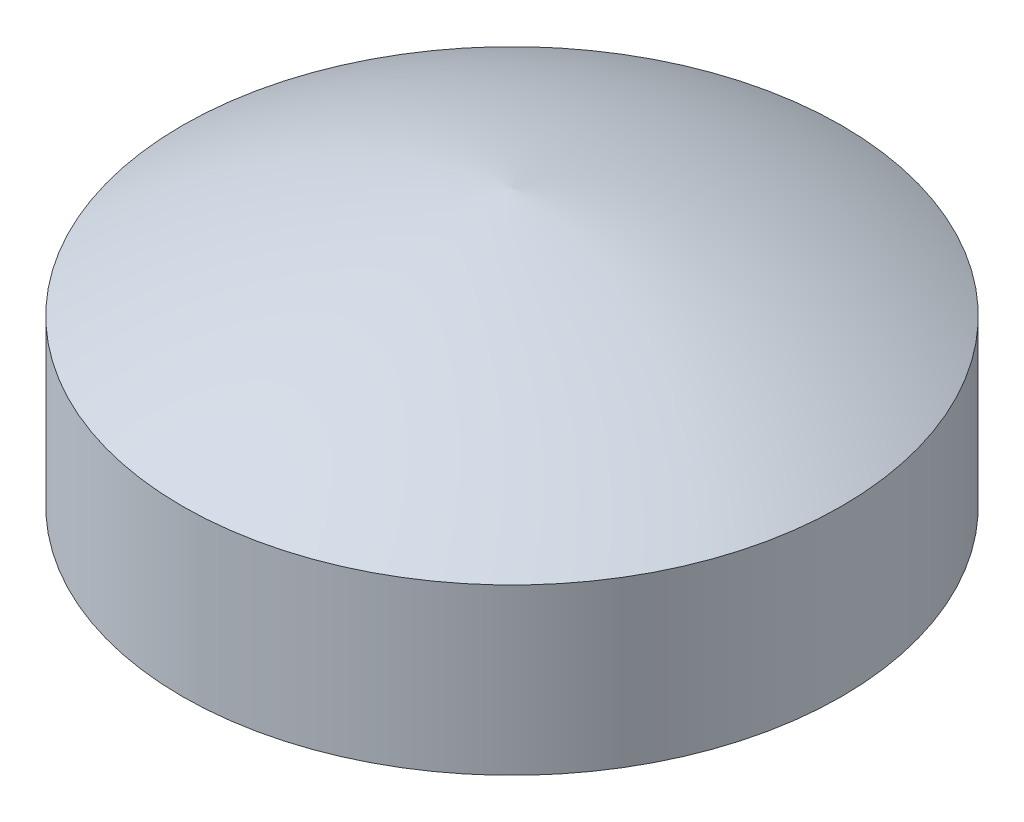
ISO-10303-21;
HEADER;
FILE_DESCRIPTION(('STEP AP214'),'2;1');
FILE_NAME('part.step','',(''),(''),'','','');
FILE_SCHEMA(('AUTOMOTIVE_DESIGN { 1 0 10303 214 1 1 1 1 }'));
ENDSEC;
DATA;
#1=APPLICATION_CONTEXT('core data for automotive mechanical design processes');
#2=APPLICATION_PROTOCOL_DEFINITION('international standard','automotive_design',2000,#1);
#3=PRODUCT_CONTEXT('',#1,'mechanical');
#4=PRODUCT('Part','Part','',(#3));
#5=PRODUCT_RELATED_PRODUCT_CATEGORY('part','',(#4));
#6=PRODUCT_DEFINITION_FORMATION('','',#4);
#7=PRODUCT_DEFINITION_CONTEXT('part definition',#1,'design');
#8=PRODUCT_DEFINITION('design','',#6,#7);
#9=PRODUCT_DEFINITION_SHAPE('','',#8);
#10=(LENGTH_UNIT() NAMED_UNIT(*) SI_UNIT(.MILLI.,.METRE.));
#11=(NAMED_UNIT(*) PLANE_ANGLE_UNIT() SI_UNIT($,.RADIAN.));
#12=(NAMED_UNIT(*) SI_UNIT($,.STERADIAN.) SOLID_ANGLE_UNIT());
#13=UNCERTAINTY_MEASURE_WITH_UNIT(LENGTH_MEASURE(1.E-05),#10,'distance_accuracy_value','');
#14=(GEOMETRIC_REPRESENTATION_CONTEXT(3) GLOBAL_UNCERTAINTY_ASSIGNED_CONTEXT((#13)) GLOBAL_UNIT_ASSIGNED_CONTEXT((#10,
#11,#12)) REPRESENTATION_CONTEXT('',''));
#15=CARTESIAN_POINT('',(0.,0.,0.));
#16=DIRECTION('',(0.,0.,1.));
#17=DIRECTION('',(1.,0.,0.));
#18=AXIS2_PLACEMENT_3D('',#15,#16,#17);
#19=CARTESIAN_POINT('',(0.,-5.17827346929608,0.892757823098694));
#20=DIRECTION('',(-1.,0.,0.));
#21=DIRECTION('',(0.,0.,-1.));
#22=AXIS2_PLACEMENT_3D('',#19,#20,#21);
#23=CIRCLE('',#22,7.73);
#24=TRIMMED_CURVE('',#23,(PARAMETER_VALUE(-1.45504541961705)),
(PARAMETER_VALUE(1.45504541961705)),.T.,.PARAMETER.);
#25=CARTESIAN_POINT('',(0.,-5.17827346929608,0.));
#26=DIRECTION('',(0.,-1.,0.));
#27=AXIS1_PLACEMENT('',#25,#26);
#28=SURFACE_OF_REVOLUTION('',#24,#27);
#29=CARTESIAN_POINT('',(0.,2.5,0.));
#30=VERTEX_POINT('',#29);
#31=VERTEX_LOOP('',#30);
#32=FACE_BOUND('',#31,.T.);
#33=CARTESIAN_POINT('',(0.,1.5,0.));
#34=DIRECTION('',(0.,-1.,0.));
#35=DIRECTION('',(0.,0.,-1.));
#36=AXIS2_PLACEMENT_3D('',#33,#34,#35);
#37=CIRCLE('',#36,3.);
#38=CARTESIAN_POINT('',(0.,1.5,-3.));
#39=VERTEX_POINT('',#38);
#40=EDGE_CURVE('E11',#39,#39,#37,.T.);
#41=ORIENTED_EDGE('',*,*,#40,.F.);
#42=EDGE_LOOP('',(#41));
#43=FACE_BOUND('',#42,.T.);
#44=ADVANCED_FACE('F35',(#32,#43),#28,.T.);
#45=CARTESIAN_POINT('',(0.,0.,0.));
#46=DIRECTION('',(0.,-1.,0.));
#47=DIRECTION('',(0.,0.,-1.));
#48=AXIS2_PLACEMENT_3D('',#45,#46,#47);
#49=CYLINDRICAL_SURFACE('',#48,3.);
#50=ORIENTED_EDGE('',*,*,#40,.T.);
#51=EDGE_LOOP('',(#50));
#52=FACE_BOUND('',#51,.T.);
#53=CARTESIAN_POINT('',(0.,0.,0.));
#54=DIRECTION('',(0.,-1.,0.));
#55=DIRECTION('',(0.,0.,-1.));
#56=AXIS2_PLACEMENT_3D('',#53,#54,#55);
#57=CIRCLE('',#56,3.);
#58=CARTESIAN_POINT('',(0.,0.,-3.));
#59=VERTEX_POINT('',#58);
#60=EDGE_CURVE('E41',#59,#59,#57,.T.);
#61=ORIENTED_EDGE('',*,*,#60,.F.);
#62=EDGE_LOOP('',(#61));
#63=FACE_BOUND('',#62,.T.);
#64=ADVANCED_FACE('F46',(#52,#63),#49,.T.);
#65=CARTESIAN_POINT('',(0.,0.,0.));
#66=DIRECTION('',(0.,-1.,0.));
#67=DIRECTION('',(0.,0.,-1.));
#68=AXIS2_PLACEMENT_3D('',#65,#66,#67);
#69=PLANE('',#68);
#70=ORIENTED_EDGE('',*,*,#60,.T.);
#71=EDGE_LOOP('',(#70));
#72=FACE_BOUND('',#71,.T.);
#73=ADVANCED_FACE('F51',(#72),#69,.T.);
#74=CLOSED_SHELL('',(#44,#64,#73));
#75=MANIFOLD_SOLID_BREP('B2',#74);
#76=ADVANCED_BREP_SHAPE_REPRESENTATION('',(#18,#75),#14);
#77=SHAPE_DEFINITION_REPRESENTATION(#9,#76);
ENDSEC;
END-ISO-10303-21;
